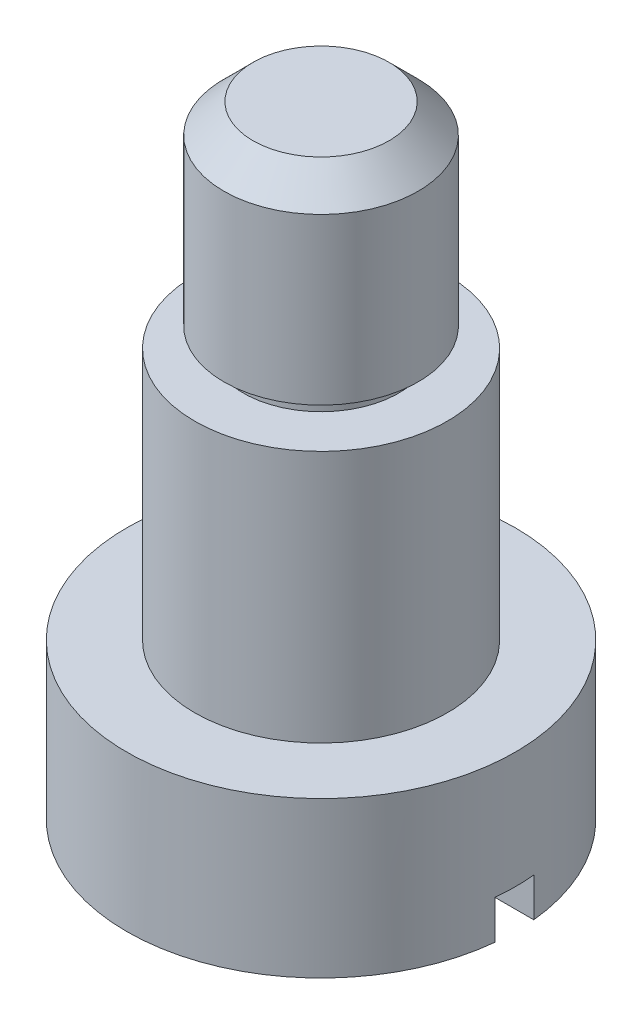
ISO-10303-21;
HEADER;
FILE_DESCRIPTION(('STEP AP214'),'2;1');
FILE_NAME('part.step','',(''),(''),'','','');
FILE_SCHEMA(('AUTOMOTIVE_DESIGN { 1 0 10303 214 1 1 1 1 }'));
ENDSEC;
DATA;
#1=APPLICATION_CONTEXT('core data for automotive mechanical design processes');
#2=APPLICATION_PROTOCOL_DEFINITION('international standard','automotive_design',2000,#1);
#3=PRODUCT_CONTEXT('',#1,'mechanical');
#4=PRODUCT('Part','Part','',(#3));
#5=PRODUCT_RELATED_PRODUCT_CATEGORY('part','',(#4));
#6=PRODUCT_DEFINITION_FORMATION('','',#4);
#7=PRODUCT_DEFINITION_CONTEXT('part definition',#1,'design');
#8=PRODUCT_DEFINITION('design','',#6,#7);
#9=PRODUCT_DEFINITION_SHAPE('','',#8);
#10=(LENGTH_UNIT() NAMED_UNIT(*) SI_UNIT(.MILLI.,.METRE.));
#11=(NAMED_UNIT(*) PLANE_ANGLE_UNIT() SI_UNIT($,.RADIAN.));
#12=(NAMED_UNIT(*) SI_UNIT($,.STERADIAN.) SOLID_ANGLE_UNIT());
#13=UNCERTAINTY_MEASURE_WITH_UNIT(LENGTH_MEASURE(1.E-05),#10,'distance_accuracy_value','');
#14=(GEOMETRIC_REPRESENTATION_CONTEXT(3) GLOBAL_UNCERTAINTY_ASSIGNED_CONTEXT((#13)) GLOBAL_UNIT_ASSIGNED_CONTEXT((#10,
#11,#12)) REPRESENTATION_CONTEXT('',''));
#15=CARTESIAN_POINT('',(0.,0.,0.));
#16=DIRECTION('',(0.,0.,1.));
#17=DIRECTION('',(1.,0.,0.));
#18=AXIS2_PLACEMENT_3D('',#15,#16,#17);
#19=CARTESIAN_POINT('',(10.,0.,0.));
#20=DIRECTION('',(0.,-1.,0.));
#21=DIRECTION('',(0.,0.,-1.));
#22=AXIS2_PLACEMENT_3D('',#19,#20,#21);
#23=PLANE('',#22);
#24=DIRECTION('',(1.,0.,0.));
#25=VECTOR('',#24,1.);
#26=CARTESIAN_POINT('',(9.9498743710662,0.,-1.));
#27=LINE('',#26,#25);
#28=CARTESIAN_POINT('',(-9.9498743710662,0.,-0.999999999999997));
#29=VERTEX_POINT('',#28);
#30=CARTESIAN_POINT('',(9.9498743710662,0.,-1.));
#31=VERTEX_POINT('',#30);
#32=EDGE_CURVE('E78',#29,#31,#27,.T.);
#33=ORIENTED_EDGE('',*,*,#32,.F.);
#34=CARTESIAN_POINT('',(0.,0.,0.));
#35=DIRECTION('',(0.,-1.,0.));
#36=DIRECTION('',(0.,0.,-1.));
#37=AXIS2_PLACEMENT_3D('',#34,#35,#36);
#38=CIRCLE('',#37,10.);
#39=EDGE_CURVE('E91',#29,#31,#38,.T.);
#40=ORIENTED_EDGE('',*,*,#39,.T.);
#41=EDGE_LOOP('',(#33,#40));
#42=FACE_BOUND('',#41,.T.);
#43=ADVANCED_FACE('F31',(#42),#23,.T.);
#44=CARTESIAN_POINT('',(0.,32.,0.));
#45=DIRECTION('',(0.,1.,0.));
#46=DIRECTION('',(0.,0.,1.));
#47=AXIS2_PLACEMENT_3D('',#44,#45,#46);
#48=PLANE('',#47);
#49=CARTESIAN_POINT('',(0.,32.,0.));
#50=DIRECTION('',(0.,1.,0.));
#51=DIRECTION('',(0.,0.,1.));
#52=AXIS2_PLACEMENT_3D('',#49,#50,#51);
#53=CIRCLE('',#52,3.49999999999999);
#54=CARTESIAN_POINT('',(0.,32.,3.49999999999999));
#55=VERTEX_POINT('',#54);
#56=EDGE_CURVE('E11',#55,#55,#53,.T.);
#57=ORIENTED_EDGE('',*,*,#56,.T.);
#58=EDGE_LOOP('',(#57));
#59=FACE_BOUND('',#58,.T.);
#60=ADVANCED_FACE('F33',(#59),#48,.T.);
#61=CARTESIAN_POINT('',(0.,-26.,0.));
#62=DIRECTION('',(0.,-1.,0.));
#63=DIRECTION('',(0.,0.,-1.));
#64=AXIS2_PLACEMENT_3D('',#61,#62,#63);
#65=CYLINDRICAL_SURFACE('',#64,5.);
#66=CARTESIAN_POINT('',(0.,30.5,0.));
#67=DIRECTION('',(0.,1.,0.));
#68=DIRECTION('',(0.,0.,1.));
#69=AXIS2_PLACEMENT_3D('',#66,#67,#68);
#70=CIRCLE('',#69,5.);
#71=CARTESIAN_POINT('',(0.,30.5,5.));
#72=VERTEX_POINT('',#71);
#73=EDGE_CURVE('E39',#72,#72,#70,.F.);
#74=ORIENTED_EDGE('',*,*,#73,.T.);
#75=EDGE_LOOP('',(#74));
#76=FACE_BOUND('',#75,.T.);
#77=CARTESIAN_POINT('',(0.,22.,0.));
#78=DIRECTION('',(0.,-1.,0.));
#79=DIRECTION('',(0.,0.,-1.));
#80=AXIS2_PLACEMENT_3D('',#77,#78,#79);
#81=CIRCLE('',#80,5.);
#82=CARTESIAN_POINT('',(0.,22.,-5.));
#83=VERTEX_POINT('',#82);
#84=EDGE_CURVE('E110',#83,#83,#81,.T.);
#85=ORIENTED_EDGE('',*,*,#84,.F.);
#86=EDGE_LOOP('',(#85));
#87=FACE_BOUND('',#86,.T.);
#88=ADVANCED_FACE('F115',(#76,#87),#65,.T.);
#89=CARTESIAN_POINT('',(5.,22.,0.));
#90=DIRECTION('',(0.,-1.,0.));
#91=DIRECTION('',(0.,0.,-1.));
#92=AXIS2_PLACEMENT_3D('',#89,#90,#91);
#93=PLANE('',#92);
#94=ORIENTED_EDGE('',*,*,#84,.T.);
#95=EDGE_LOOP('',(#94));
#96=FACE_BOUND('',#95,.T.);
#97=CARTESIAN_POINT('',(0.,22.,0.));
#98=DIRECTION('',(0.,-1.,0.));
#99=DIRECTION('',(0.,0.,-1.));
#100=AXIS2_PLACEMENT_3D('',#97,#98,#99);
#101=CIRCLE('',#100,4.);
#102=CARTESIAN_POINT('',(0.,22.,-4.));
#103=VERTEX_POINT('',#102);
#104=EDGE_CURVE('E107',#103,#103,#101,.T.);
#105=ORIENTED_EDGE('',*,*,#104,.F.);
#106=EDGE_LOOP('',(#105));
#107=FACE_BOUND('',#106,.T.);
#108=ADVANCED_FACE('F156',(#96,#107),#93,.T.);
#109=CARTESIAN_POINT('',(0.,-26.,0.));
#110=DIRECTION('',(0.,-1.,0.));
#111=DIRECTION('',(0.,0.,-1.));
#112=AXIS2_PLACEMENT_3D('',#109,#110,#111);
#113=CYLINDRICAL_SURFACE('',#112,4.);
#114=ORIENTED_EDGE('',*,*,#104,.T.);
#115=EDGE_LOOP('',(#114));
#116=FACE_BOUND('',#115,.T.);
#117=CARTESIAN_POINT('',(0.,21.,0.));
#118=DIRECTION('',(0.,-1.,0.));
#119=DIRECTION('',(0.,0.,-1.));
#120=AXIS2_PLACEMENT_3D('',#117,#118,#119);
#121=CIRCLE('',#120,4.);
#122=CARTESIAN_POINT('',(0.,21.,-4.));
#123=VERTEX_POINT('',#122);
#124=EDGE_CURVE('E104',#123,#123,#121,.T.);
#125=ORIENTED_EDGE('',*,*,#124,.F.);
#126=EDGE_LOOP('',(#125));
#127=FACE_BOUND('',#126,.T.);
#128=ADVANCED_FACE('F152',(#116,#127),#113,.T.);
#129=CARTESIAN_POINT('',(4.,21.,0.));
#130=DIRECTION('',(0.,1.,0.));
#131=DIRECTION('',(0.,0.,1.));
#132=AXIS2_PLACEMENT_3D('',#129,#130,#131);
#133=PLANE('',#132);
#134=ORIENTED_EDGE('',*,*,#124,.T.);
#135=EDGE_LOOP('',(#134));
#136=FACE_BOUND('',#135,.T.);
#137=CARTESIAN_POINT('',(0.,21.,0.));
#138=DIRECTION('',(0.,-1.,0.));
#139=DIRECTION('',(0.,0.,-1.));
#140=AXIS2_PLACEMENT_3D('',#137,#138,#139);
#141=CIRCLE('',#140,6.5);
#142=CARTESIAN_POINT('',(0.,21.,-6.5));
#143=VERTEX_POINT('',#142);
#144=EDGE_CURVE('E101',#143,#143,#141,.T.);
#145=ORIENTED_EDGE('',*,*,#144,.F.);
#146=EDGE_LOOP('',(#145));
#147=FACE_BOUND('',#146,.T.);
#148=ADVANCED_FACE('F148',(#136,#147),#133,.T.);
#149=CARTESIAN_POINT('',(0.,-26.,0.));
#150=DIRECTION('',(0.,-1.,0.));
#151=DIRECTION('',(0.,0.,-1.));
#152=AXIS2_PLACEMENT_3D('',#149,#150,#151);
#153=CYLINDRICAL_SURFACE('',#152,6.5);
#154=ORIENTED_EDGE('',*,*,#144,.T.);
#155=EDGE_LOOP('',(#154));
#156=FACE_BOUND('',#155,.T.);
#157=CARTESIAN_POINT('',(0.,8.,0.));
#158=DIRECTION('',(0.,-1.,0.));
#159=DIRECTION('',(0.,0.,-1.));
#160=AXIS2_PLACEMENT_3D('',#157,#158,#159);
#161=CIRCLE('',#160,6.5);
#162=CARTESIAN_POINT('',(0.,8.,-6.5));
#163=VERTEX_POINT('',#162);
#164=EDGE_CURVE('E94',#163,#163,#161,.T.);
#165=ORIENTED_EDGE('',*,*,#164,.F.);
#166=EDGE_LOOP('',(#165));
#167=FACE_BOUND('',#166,.T.);
#168=ADVANCED_FACE('F144',(#156,#167),#153,.T.);
#169=CARTESIAN_POINT('',(6.5,8.,0.));
#170=DIRECTION('',(0.,1.,0.));
#171=DIRECTION('',(0.,0.,1.));
#172=AXIS2_PLACEMENT_3D('',#169,#170,#171);
#173=PLANE('',#172);
#174=ORIENTED_EDGE('',*,*,#164,.T.);
#175=EDGE_LOOP('',(#174));
#176=FACE_BOUND('',#175,.T.);
#177=CARTESIAN_POINT('',(0.,8.,0.));
#178=DIRECTION('',(0.,-1.,0.));
#179=DIRECTION('',(0.,0.,-1.));
#180=AXIS2_PLACEMENT_3D('',#177,#178,#179);
#181=CIRCLE('',#180,9.99999999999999);
#182=CARTESIAN_POINT('',(0.,8.,-9.99999999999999));
#183=VERTEX_POINT('',#182);
#184=EDGE_CURVE('E90',#183,#183,#181,.T.);
#185=ORIENTED_EDGE('',*,*,#184,.F.);
#186=EDGE_LOOP('',(#185));
#187=FACE_BOUND('',#186,.T.);
#188=ADVANCED_FACE('F141',(#176,#187),#173,.T.);
#189=CARTESIAN_POINT('',(0.,-26.,0.));
#190=DIRECTION('',(0.,-1.,0.));
#191=DIRECTION('',(0.,0.,-1.));
#192=AXIS2_PLACEMENT_3D('',#189,#190,#191);
#193=CYLINDRICAL_SURFACE('',#192,9.99999999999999);
#194=DIRECTION('',(0.,-1.,0.));
#195=VECTOR('',#194,1.);
#196=CARTESIAN_POINT('',(-9.9498743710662,2.,-0.999999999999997));
#197=LINE('',#196,#195);
#198=CARTESIAN_POINT('',(-9.9498743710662,2.,-0.999999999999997));
#199=VERTEX_POINT('',#198);
#200=EDGE_CURVE('E87',#199,#29,#197,.T.);
#201=ORIENTED_EDGE('',*,*,#200,.F.);
#202=CARTESIAN_POINT('',(0.,2.,0.));
#203=DIRECTION('',(0.,-1.,0.));
#204=DIRECTION('',(0.,0.,-1.));
#205=AXIS2_PLACEMENT_3D('',#202,#203,#204);
#206=CIRCLE('',#205,10.);
#207=CARTESIAN_POINT('',(-9.9498743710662,2.,0.999999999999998));
#208=VERTEX_POINT('',#207);
#209=EDGE_CURVE('E86',#208,#199,#206,.T.);
#210=ORIENTED_EDGE('',*,*,#209,.F.);
#211=DIRECTION('',(0.,-1.,0.));
#212=VECTOR('',#211,1.);
#213=CARTESIAN_POINT('',(-9.9498743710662,2.,0.999999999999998));
#214=LINE('',#213,#212);
#215=CARTESIAN_POINT('',(-9.9498743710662,0.,0.999999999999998));
#216=VERTEX_POINT('',#215);
#217=EDGE_CURVE('E73',#208,#216,#214,.T.);
#218=ORIENTED_EDGE('',*,*,#217,.T.);
#219=CARTESIAN_POINT('',(9.9498743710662,0.,1.));
#220=VERTEX_POINT('',#219);
#221=EDGE_CURVE('E85',#220,#216,#38,.T.);
#222=ORIENTED_EDGE('',*,*,#221,.F.);
#223=DIRECTION('',(0.,-1.,0.));
#224=VECTOR('',#223,1.);
#225=CARTESIAN_POINT('',(9.9498743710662,2.,1.));
#226=LINE('',#225,#224);
#227=CARTESIAN_POINT('',(9.9498743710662,2.,1.));
#228=VERTEX_POINT('',#227);
#229=EDGE_CURVE('E46',#228,#220,#226,.T.);
#230=ORIENTED_EDGE('',*,*,#229,.F.);
#231=CARTESIAN_POINT('',(0.,2.,0.));
#232=DIRECTION('',(0.,-1.,0.));
#233=DIRECTION('',(0.,0.,-1.));
#234=AXIS2_PLACEMENT_3D('',#231,#232,#233);
#235=CIRCLE('',#234,10.);
#236=CARTESIAN_POINT('',(9.9498743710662,2.,-1.));
#237=VERTEX_POINT('',#236);
#238=EDGE_CURVE('E227',#237,#228,#235,.T.);
#239=ORIENTED_EDGE('',*,*,#238,.F.);
#240=DIRECTION('',(0.,-1.,0.));
#241=VECTOR('',#240,1.);
#242=CARTESIAN_POINT('',(9.9498743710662,2.,-1.));
#243=LINE('',#242,#241);
#244=EDGE_CURVE('E54',#237,#31,#243,.T.);
#245=ORIENTED_EDGE('',*,*,#244,.T.);
#246=ORIENTED_EDGE('',*,*,#39,.F.);
#247=EDGE_LOOP('',(#201,#210,#218,#222,#230,#239,#245,#246));
#248=FACE_BOUND('',#247,.T.);
#249=ORIENTED_EDGE('',*,*,#184,.T.);
#250=EDGE_LOOP('',(#249));
#251=FACE_BOUND('',#250,.T.);
#252=ADVANCED_FACE('F83',(#248,#251),#193,.T.);
#253=DIRECTION('',(-1.,0.,0.));
#254=VECTOR('',#253,1.);
#255=CARTESIAN_POINT('',(9.9498743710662,0.,1.));
#256=LINE('',#255,#254);
#257=EDGE_CURVE('E70',#220,#216,#256,.T.);
#258=ORIENTED_EDGE('',*,*,#257,.F.);
#259=ORIENTED_EDGE('',*,*,#221,.T.);
#260=EDGE_LOOP('',(#258,#259));
#261=FACE_BOUND('',#260,.T.);
#262=ADVANCED_FACE('F89',(#261),#23,.T.);
#263=CARTESIAN_POINT('',(0.,30.5,0.));
#264=DIRECTION('',(0.,-1.,0.));
#265=DIRECTION('',(0.,0.,-1.));
#266=AXIS2_PLACEMENT_3D('',#263,#264,#265);
#267=CONICAL_SURFACE('',#266,5.,0.78539816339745);
#268=ORIENTED_EDGE('',*,*,#56,.F.);
#269=EDGE_LOOP('',(#268));
#270=FACE_BOUND('',#269,.T.);
#271=ORIENTED_EDGE('',*,*,#73,.F.);
#272=EDGE_LOOP('',(#271));
#273=FACE_BOUND('',#272,.T.);
#274=ADVANCED_FACE('F118',(#270,#273),#267,.T.);
#275=CARTESIAN_POINT('',(9.9498743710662,2.,-1.));
#276=DIRECTION('',(0.,0.,-1.));
#277=DIRECTION('',(-1.,0.,0.));
#278=AXIS2_PLACEMENT_3D('',#275,#276,#277);
#279=PLANE('',#278);
#280=ORIENTED_EDGE('',*,*,#32,.T.);
#281=ORIENTED_EDGE('',*,*,#244,.F.);
#282=DIRECTION('',(1.,0.,0.));
#283=VECTOR('',#282,1.);
#284=CARTESIAN_POINT('',(9.9498743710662,2.,-1.));
#285=LINE('',#284,#283);
#286=EDGE_CURVE('E229',#199,#237,#285,.T.);
#287=ORIENTED_EDGE('',*,*,#286,.F.);
#288=ORIENTED_EDGE('',*,*,#200,.T.);
#289=EDGE_LOOP('',(#280,#281,#287,#288));
#290=FACE_BOUND('',#289,.T.);
#291=ADVANCED_FACE('F120',(#290),#279,.F.);
#292=CARTESIAN_POINT('',(9.9498743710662,2.,1.));
#293=DIRECTION('',(0.,0.,1.));
#294=DIRECTION('',(1.,0.,0.));
#295=AXIS2_PLACEMENT_3D('',#292,#293,#294);
#296=PLANE('',#295);
#297=ORIENTED_EDGE('',*,*,#257,.T.);
#298=ORIENTED_EDGE('',*,*,#217,.F.);
#299=DIRECTION('',(-1.,0.,0.));
#300=VECTOR('',#299,1.);
#301=CARTESIAN_POINT('',(9.9498743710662,2.,1.));
#302=LINE('',#301,#300);
#303=EDGE_CURVE('E228',#228,#208,#302,.T.);
#304=ORIENTED_EDGE('',*,*,#303,.F.);
#305=ORIENTED_EDGE('',*,*,#229,.T.);
#306=EDGE_LOOP('',(#297,#298,#304,#305));
#307=FACE_BOUND('',#306,.T.);
#308=ADVANCED_FACE('F72',(#307),#296,.F.);
#309=CARTESIAN_POINT('',(0.,2.,0.));
#310=DIRECTION('',(0.,-1.,0.));
#311=DIRECTION('',(0.,0.,-1.));
#312=AXIS2_PLACEMENT_3D('',#309,#310,#311);
#313=PLANE('',#312);
#314=ORIENTED_EDGE('',*,*,#238,.T.);
#315=ORIENTED_EDGE('',*,*,#303,.T.);
#316=ORIENTED_EDGE('',*,*,#209,.T.);
#317=ORIENTED_EDGE('',*,*,#286,.T.);
#318=EDGE_LOOP('',(#314,#315,#316,#317));
#319=FACE_BOUND('',#318,.T.);
#320=ADVANCED_FACE('F213',(#319),#313,.T.);
#321=CLOSED_SHELL('',(#43,#60,#88,#108,#128,#148,#168,#188,#252,#262,#274,#291,#308,#320));
#322=MANIFOLD_SOLID_BREP('B2',#321);
#323=ADVANCED_BREP_SHAPE_REPRESENTATION('',(#18,#322),#14);
#324=SHAPE_DEFINITION_REPRESENTATION(#9,#323);
ENDSEC;
END-ISO-10303-21;
